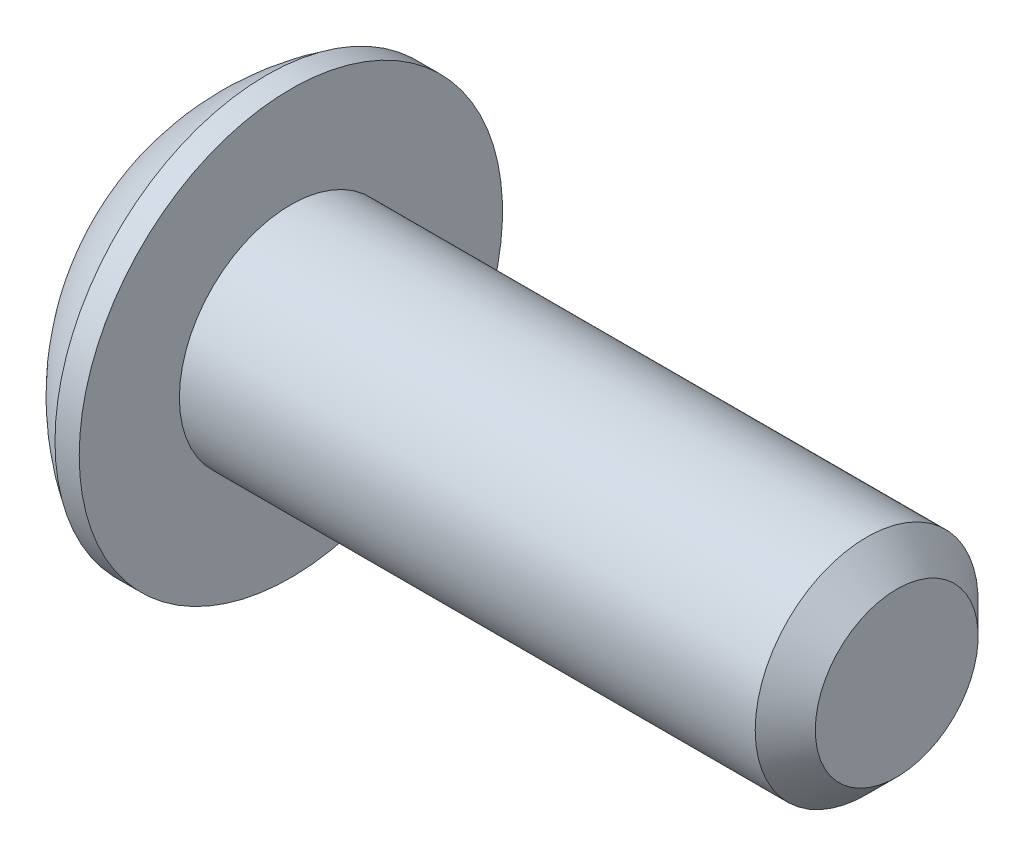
from build123d import *

# Parameters (mm, degrees)
HEX_2_DEPTH = 1.1176


with BuildPart() as part:
    # BodySke → BaseBody (revolve)
    with BuildSketch(Plane.XY, mode=Mode.PRIVATE) as basebody_sk:
        with BuildLine():
            Line((11.3792, 0), (11.3792, 1.28016))
            Line((11.3792, 1.28016), (10.90676, 1.7526))
            Line((10.90676, 1.7526), (1.8542, 1.7526))
            Line((1.8542, 1.7526), (1.8542, 3.3274))
            Line((1.8542, 3.3274), (1.4732, 3.3274))
            ThreePointArc((1.4732, 3.3274), (0.616396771, 2.601989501), (0, 1.6637))
            Line((0, 1.6637), (0, 0))
            Line((0, 0), (11.3792, 0))
        make_face()
    revolve(basebody_sk.sketch.rotate(Axis((0, 0, 0), (1, 0, 0)), 90), axis=Axis((0, 0, 0), (1, 0, 0)))

    # Sketch2 → PreBroach (revolve, cut)
    with BuildSketch(Plane.XY, mode=Mode.PRIVATE) as prebroach_sk:
        Polygon((0, 0.9906), (1.1176, 0.9906), (1.689523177, 0), (0, 0), align=None)
    revolve(prebroach_sk.sketch.rotate(Axis((0, 0, 0), (1, 0, 0)), 90), axis=Axis((0, 0, 0), (1, 0, 0)), mode=Mode.SUBTRACT)

    # Sketch3 → Hex 2 (cut)
    with BuildSketch(Plane(origin=(0, 0, 0), x_dir=(0, 0, -1), z_dir=(1, 0, 0))):
        Polygon((-0.9906, -0.571923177), (-0.9906, 0.571923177), (0, 1.143846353), (0.9906, 0.571923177), (0.9906, -0.571923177), (0, -1.143846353), align=None)
    extrude(amount=HEX_2_DEPTH, mode=Mode.SUBTRACT)


solid = part.part
